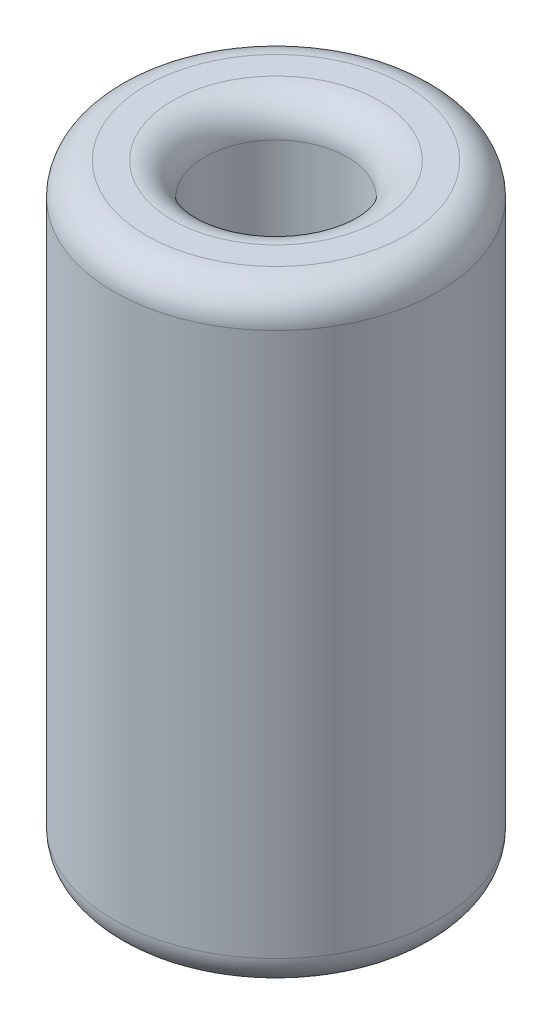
ISO-10303-21;
HEADER;
FILE_DESCRIPTION(('STEP AP214'),'2;1');
FILE_NAME('part.step','',(''),(''),'','','');
FILE_SCHEMA(('AUTOMOTIVE_DESIGN { 1 0 10303 214 1 1 1 1 }'));
ENDSEC;
DATA;
#1=APPLICATION_CONTEXT('core data for automotive mechanical design processes');
#2=APPLICATION_PROTOCOL_DEFINITION('international standard','automotive_design',2000,#1);
#3=PRODUCT_CONTEXT('',#1,'mechanical');
#4=PRODUCT('Part','Part','',(#3));
#5=PRODUCT_RELATED_PRODUCT_CATEGORY('part','',(#4));
#6=PRODUCT_DEFINITION_FORMATION('','',#4);
#7=PRODUCT_DEFINITION_CONTEXT('part definition',#1,'design');
#8=PRODUCT_DEFINITION('design','',#6,#7);
#9=PRODUCT_DEFINITION_SHAPE('','',#8);
#10=(LENGTH_UNIT() NAMED_UNIT(*) SI_UNIT(.MILLI.,.METRE.));
#11=(NAMED_UNIT(*) PLANE_ANGLE_UNIT() SI_UNIT($,.RADIAN.));
#12=(NAMED_UNIT(*) SI_UNIT($,.STERADIAN.) SOLID_ANGLE_UNIT());
#13=UNCERTAINTY_MEASURE_WITH_UNIT(LENGTH_MEASURE(1.E-05),#10,'distance_accuracy_value','');
#14=(GEOMETRIC_REPRESENTATION_CONTEXT(3) GLOBAL_UNCERTAINTY_ASSIGNED_CONTEXT((#13)) GLOBAL_UNIT_ASSIGNED_CONTEXT((#10,
#11,#12)) REPRESENTATION_CONTEXT('',''));
#15=CARTESIAN_POINT('',(0.,0.,0.));
#16=DIRECTION('',(0.,0.,1.));
#17=DIRECTION('',(1.,0.,0.));
#18=AXIS2_PLACEMENT_3D('',#15,#16,#17);
#19=CARTESIAN_POINT('',(0.,0.8,0.));
#20=DIRECTION('',(0.,-1.,0.));
#21=DIRECTION('',(0.,0.,-1.));
#22=AXIS2_PLACEMENT_3D('',#19,#20,#21);
#23=TOROIDAL_SURFACE('',#22,3.2,0.8);
#24=CARTESIAN_POINT('',(0.,0.800000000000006,0.));
#25=DIRECTION('',(0.,-1.,0.));
#26=DIRECTION('',(0.,0.,-1.));
#27=AXIS2_PLACEMENT_3D('',#24,#25,#26);
#28=CIRCLE('',#27,4.);
#29=CARTESIAN_POINT('',(0.,0.800000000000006,-4.));
#30=VERTEX_POINT('',#29);
#31=EDGE_CURVE('E63',#30,#30,#28,.T.);
#32=ORIENTED_EDGE('',*,*,#31,.T.);
#33=EDGE_LOOP('',(#32));
#34=FACE_BOUND('',#33,.T.);
#35=CARTESIAN_POINT('',(0.,0.,0.));
#36=DIRECTION('',(0.,-1.,0.));
#37=DIRECTION('',(0.,0.,-1.));
#38=AXIS2_PLACEMENT_3D('',#35,#36,#37);
#39=CIRCLE('',#38,3.19999999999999);
#40=CARTESIAN_POINT('',(0.,0.,-3.19999999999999));
#41=VERTEX_POINT('',#40);
#42=EDGE_CURVE('E10',#41,#41,#39,.T.);
#43=ORIENTED_EDGE('',*,*,#42,.F.);
#44=EDGE_LOOP('',(#43));
#45=FACE_BOUND('',#44,.T.);
#46=ADVANCED_FACE('F35',(#34,#45),#23,.T.);
#47=CARTESIAN_POINT('',(2.55000000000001,0.,0.));
#48=DIRECTION('',(0.,-1.,0.));
#49=DIRECTION('',(0.,0.,-1.));
#50=AXIS2_PLACEMENT_3D('',#47,#48,#49);
#51=PLANE('',#50);
#52=ORIENTED_EDGE('',*,*,#42,.T.);
#53=EDGE_LOOP('',(#52));
#54=FACE_BOUND('',#53,.T.);
#55=CARTESIAN_POINT('',(0.,0.,0.));
#56=DIRECTION('',(0.,-1.,0.));
#57=DIRECTION('',(0.,0.,-1.));
#58=AXIS2_PLACEMENT_3D('',#55,#56,#57);
#59=CIRCLE('',#58,2.55000000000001);
#60=CARTESIAN_POINT('',(0.,0.,-2.55000000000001));
#61=VERTEX_POINT('',#60);
#62=EDGE_CURVE('E41',#61,#61,#59,.T.);
#63=ORIENTED_EDGE('',*,*,#62,.F.);
#64=EDGE_LOOP('',(#63));
#65=FACE_BOUND('',#64,.T.);
#66=ADVANCED_FACE('F81',(#54,#65),#51,.T.);
#67=CARTESIAN_POINT('',(0.,0.8,0.));
#68=DIRECTION('',(0.,-1.,0.));
#69=DIRECTION('',(0.,0.,-1.));
#70=AXIS2_PLACEMENT_3D('',#67,#68,#69);
#71=TOROIDAL_SURFACE('',#70,2.55,0.8);
#72=ORIENTED_EDGE('',*,*,#62,.T.);
#73=EDGE_LOOP('',(#72));
#74=FACE_BOUND('',#73,.T.);
#75=CARTESIAN_POINT('',(0.,0.800000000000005,0.));
#76=DIRECTION('',(0.,-1.,0.));
#77=DIRECTION('',(0.,0.,-1.));
#78=AXIS2_PLACEMENT_3D('',#75,#76,#77);
#79=CIRCLE('',#78,1.75);
#80=CARTESIAN_POINT('',(0.,0.800000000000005,-1.75));
#81=VERTEX_POINT('',#80);
#82=EDGE_CURVE('E45',#81,#81,#79,.T.);
#83=ORIENTED_EDGE('',*,*,#82,.F.);
#84=EDGE_LOOP('',(#83));
#85=FACE_BOUND('',#84,.T.);
#86=ADVANCED_FACE('F85',(#74,#85),#71,.T.);
#87=CARTESIAN_POINT('',(0.,0.,0.));
#88=DIRECTION('',(0.,-1.,0.));
#89=DIRECTION('',(0.,0.,-1.));
#90=AXIS2_PLACEMENT_3D('',#87,#88,#89);
#91=CYLINDRICAL_SURFACE('',#90,1.75);
#92=ORIENTED_EDGE('',*,*,#82,.T.);
#93=EDGE_LOOP('',(#92));
#94=FACE_BOUND('',#93,.T.);
#95=CARTESIAN_POINT('',(0.,14.2,0.));
#96=DIRECTION('',(0.,-1.,0.));
#97=DIRECTION('',(0.,0.,-1.));
#98=AXIS2_PLACEMENT_3D('',#95,#96,#97);
#99=CIRCLE('',#98,1.75);
#100=CARTESIAN_POINT('',(0.,14.2,-1.75));
#101=VERTEX_POINT('',#100);
#102=EDGE_CURVE('E49',#101,#101,#99,.T.);
#103=ORIENTED_EDGE('',*,*,#102,.F.);
#104=EDGE_LOOP('',(#103));
#105=FACE_BOUND('',#104,.T.);
#106=ADVANCED_FACE('F89',(#94,#105),#91,.F.);
#107=CARTESIAN_POINT('',(0.,14.2,0.));
#108=DIRECTION('',(0.,-1.,0.));
#109=DIRECTION('',(0.,0.,-1.));
#110=AXIS2_PLACEMENT_3D('',#107,#108,#109);
#111=TOROIDAL_SURFACE('',#110,2.55,0.8);
#112=ORIENTED_EDGE('',*,*,#102,.T.);
#113=EDGE_LOOP('',(#112));
#114=FACE_BOUND('',#113,.T.);
#115=CARTESIAN_POINT('',(0.,15.,0.));
#116=DIRECTION('',(0.,-1.,0.));
#117=DIRECTION('',(0.,0.,-1.));
#118=AXIS2_PLACEMENT_3D('',#115,#116,#117);
#119=CIRCLE('',#118,2.55);
#120=CARTESIAN_POINT('',(0.,15.,-2.55));
#121=VERTEX_POINT('',#120);
#122=EDGE_CURVE('E54',#121,#121,#119,.T.);
#123=ORIENTED_EDGE('',*,*,#122,.F.);
#124=EDGE_LOOP('',(#123));
#125=FACE_BOUND('',#124,.T.);
#126=ADVANCED_FACE('F95',(#114,#125),#111,.T.);
#127=CARTESIAN_POINT('',(2.55,15.,0.));
#128=DIRECTION('',(0.,1.,0.));
#129=DIRECTION('',(0.,0.,1.));
#130=AXIS2_PLACEMENT_3D('',#127,#128,#129);
#131=PLANE('',#130);
#132=ORIENTED_EDGE('',*,*,#122,.T.);
#133=EDGE_LOOP('',(#132));
#134=FACE_BOUND('',#133,.T.);
#135=CARTESIAN_POINT('',(0.,15.,0.));
#136=DIRECTION('',(0.,-1.,0.));
#137=DIRECTION('',(0.,0.,-1.));
#138=AXIS2_PLACEMENT_3D('',#135,#136,#137);
#139=CIRCLE('',#138,3.19999999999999);
#140=CARTESIAN_POINT('',(0.,15.,-3.19999999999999));
#141=VERTEX_POINT('',#140);
#142=EDGE_CURVE('E57',#141,#141,#139,.T.);
#143=ORIENTED_EDGE('',*,*,#142,.F.);
#144=EDGE_LOOP('',(#143));
#145=FACE_BOUND('',#144,.T.);
#146=ADVANCED_FACE('F77',(#134,#145),#131,.T.);
#147=CARTESIAN_POINT('',(0.,14.2,0.));
#148=DIRECTION('',(0.,-1.,0.));
#149=DIRECTION('',(0.,0.,-1.));
#150=AXIS2_PLACEMENT_3D('',#147,#148,#149);
#151=TOROIDAL_SURFACE('',#150,3.2,0.8);
#152=ORIENTED_EDGE('',*,*,#142,.T.);
#153=EDGE_LOOP('',(#152));
#154=FACE_BOUND('',#153,.T.);
#155=CARTESIAN_POINT('',(0.,14.2,0.));
#156=DIRECTION('',(0.,-1.,0.));
#157=DIRECTION('',(0.,0.,-1.));
#158=AXIS2_PLACEMENT_3D('',#155,#156,#157);
#159=CIRCLE('',#158,4.);
#160=CARTESIAN_POINT('',(0.,14.2,-4.));
#161=VERTEX_POINT('',#160);
#162=EDGE_CURVE('E60',#161,#161,#159,.T.);
#163=ORIENTED_EDGE('',*,*,#162,.F.);
#164=EDGE_LOOP('',(#163));
#165=FACE_BOUND('',#164,.T.);
#166=ADVANCED_FACE('F71',(#154,#165),#151,.T.);
#167=CARTESIAN_POINT('',(0.,0.,0.));
#168=DIRECTION('',(0.,-1.,0.));
#169=DIRECTION('',(0.,0.,-1.));
#170=AXIS2_PLACEMENT_3D('',#167,#168,#169);
#171=CYLINDRICAL_SURFACE('',#170,4.);
#172=ORIENTED_EDGE('',*,*,#162,.T.);
#173=EDGE_LOOP('',(#172));
#174=FACE_BOUND('',#173,.T.);
#175=ORIENTED_EDGE('',*,*,#31,.F.);
#176=EDGE_LOOP('',(#175));
#177=FACE_BOUND('',#176,.T.);
#178=ADVANCED_FACE('F69',(#174,#177),#171,.T.);
#179=CLOSED_SHELL('',(#46,#66,#86,#106,#126,#146,#166,#178));
#180=MANIFOLD_SOLID_BREP('B2',#179);
#181=ADVANCED_BREP_SHAPE_REPRESENTATION('',(#18,#180),#14);
#182=SHAPE_DEFINITION_REPRESENTATION(#9,#181);
ENDSEC;
END-ISO-10303-21;
